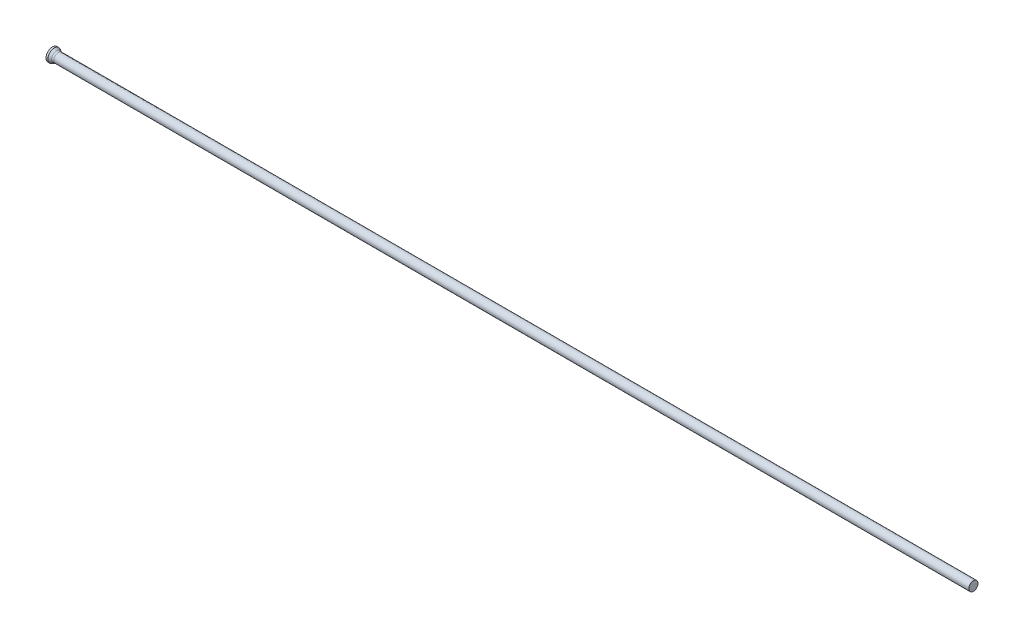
ISO-10303-21;
HEADER;
FILE_DESCRIPTION(('STEP AP214'),'2;1');
FILE_NAME('part.step','',(''),(''),'','','');
FILE_SCHEMA(('AUTOMOTIVE_DESIGN { 1 0 10303 214 1 1 1 1 }'));
ENDSEC;
DATA;
#1=APPLICATION_CONTEXT('core data for automotive mechanical design processes');
#2=APPLICATION_PROTOCOL_DEFINITION('international standard','automotive_design',2000,#1);
#3=PRODUCT_CONTEXT('',#1,'mechanical');
#4=PRODUCT('Part','Part','',(#3));
#5=PRODUCT_RELATED_PRODUCT_CATEGORY('part','',(#4));
#6=PRODUCT_DEFINITION_FORMATION('','',#4);
#7=PRODUCT_DEFINITION_CONTEXT('part definition',#1,'design');
#8=PRODUCT_DEFINITION('design','',#6,#7);
#9=PRODUCT_DEFINITION_SHAPE('','',#8);
#10=(LENGTH_UNIT() NAMED_UNIT(*) SI_UNIT(.MILLI.,.METRE.));
#11=(NAMED_UNIT(*) PLANE_ANGLE_UNIT() SI_UNIT($,.RADIAN.));
#12=(NAMED_UNIT(*) SI_UNIT($,.STERADIAN.) SOLID_ANGLE_UNIT());
#13=UNCERTAINTY_MEASURE_WITH_UNIT(LENGTH_MEASURE(1.E-05),#10,'distance_accuracy_value','');
#14=(GEOMETRIC_REPRESENTATION_CONTEXT(3) GLOBAL_UNCERTAINTY_ASSIGNED_CONTEXT((#13)) GLOBAL_UNIT_ASSIGNED_CONTEXT((#10,
#11,#12)) REPRESENTATION_CONTEXT('',''));
#15=CARTESIAN_POINT('',(0.,0.,0.));
#16=DIRECTION('',(0.,0.,1.));
#17=DIRECTION('',(1.,0.,0.));
#18=AXIS2_PLACEMENT_3D('',#15,#16,#17);
#19=CARTESIAN_POINT('',(0.,0.,0.));
#20=DIRECTION('',(1.,0.,0.));
#21=DIRECTION('',(0.,0.,-1.));
#22=AXIS2_PLACEMENT_3D('',#19,#20,#21);
#23=PLANE('',#22);
#24=CARTESIAN_POINT('',(0.,0.,0.));
#25=DIRECTION('',(-1.,0.,0.));
#26=DIRECTION('',(0.,0.,1.));
#27=AXIS2_PLACEMENT_3D('',#24,#25,#26);
#28=CIRCLE('',#27,1.75);
#29=CARTESIAN_POINT('',(0.,0.,1.75));
#30=VERTEX_POINT('',#29);
#31=EDGE_CURVE('E25',#30,#30,#28,.T.);
#32=ORIENTED_EDGE('',*,*,#31,.T.);
#33=EDGE_LOOP('',(#32));
#34=FACE_BOUND('',#33,.T.);
#35=ADVANCED_FACE('F14',(#34),#23,.F.);
#36=CARTESIAN_POINT('',(0.,0.,0.));
#37=DIRECTION('',(-1.,0.,0.));
#38=DIRECTION('',(0.,0.,1.));
#39=AXIS2_PLACEMENT_3D('',#36,#37,#38);
#40=CYLINDRICAL_SURFACE('',#39,1.75);
#41=ORIENTED_EDGE('',*,*,#31,.F.);
#42=EDGE_LOOP('',(#41));
#43=FACE_BOUND('',#42,.T.);
#44=CARTESIAN_POINT('',(0.503974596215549,0.,0.));
#45=DIRECTION('',(-1.,0.,0.));
#46=DIRECTION('',(0.,0.,1.));
#47=AXIS2_PLACEMENT_3D('',#44,#45,#46);
#48=CIRCLE('',#47,1.75);
#49=CARTESIAN_POINT('',(0.503974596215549,0.,1.75));
#50=VERTEX_POINT('',#49);
#51=EDGE_CURVE('E29',#50,#50,#48,.T.);
#52=ORIENTED_EDGE('',*,*,#51,.T.);
#53=EDGE_LOOP('',(#52));
#54=FACE_BOUND('',#53,.T.);
#55=ADVANCED_FACE('F53',(#43,#54),#40,.T.);
#56=CARTESIAN_POINT('',(1.37,0.,0.));
#57=DIRECTION('',(-1.,0.,0.));
#58=DIRECTION('',(0.,0.,1.));
#59=AXIS2_PLACEMENT_3D('',#56,#57,#58);
#60=CONICAL_SURFACE('',#59,1.25,0.523598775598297);
#61=CARTESIAN_POINT('',(1.13794919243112,0.,0.));
#62=DIRECTION('',(-1.,0.,0.));
#63=DIRECTION('',(0.,0.,1.));
#64=AXIS2_PLACEMENT_3D('',#61,#62,#63);
#65=CIRCLE('',#64,1.38397459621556);
#66=CARTESIAN_POINT('',(1.13794919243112,0.,1.38397459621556));
#67=VERTEX_POINT('',#66);
#68=EDGE_CURVE('E21',#67,#67,#65,.T.);
#69=ORIENTED_EDGE('',*,*,#68,.T.);
#70=EDGE_LOOP('',(#69));
#71=FACE_BOUND('',#70,.T.);
#72=ORIENTED_EDGE('',*,*,#51,.F.);
#73=EDGE_LOOP('',(#72));
#74=FACE_BOUND('',#73,.T.);
#75=ADVANCED_FACE('F50',(#71,#74),#60,.T.);
#76=CARTESIAN_POINT('',(0.,0.,0.));
#77=DIRECTION('',(-1.,0.,0.));
#78=DIRECTION('',(0.,0.,1.));
#79=AXIS2_PLACEMENT_3D('',#76,#77,#78);
#80=CYLINDRICAL_SURFACE('',#79,1.25);
#81=CARTESIAN_POINT('',(1.63794919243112,0.,0.));
#82=DIRECTION('',(-1.,0.,0.));
#83=DIRECTION('',(0.,0.,1.));
#84=AXIS2_PLACEMENT_3D('',#81,#82,#83);
#85=CIRCLE('',#84,1.25);
#86=CARTESIAN_POINT('',(1.63794919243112,0.,1.25));
#87=VERTEX_POINT('',#86);
#88=EDGE_CURVE('E9',#87,#87,#85,.F.);
#89=ORIENTED_EDGE('',*,*,#88,.T.);
#90=EDGE_LOOP('',(#89));
#91=FACE_BOUND('',#90,.T.);
#92=CARTESIAN_POINT('',(250.,0.,0.));
#93=DIRECTION('',(-1.,0.,0.));
#94=DIRECTION('',(0.,0.,1.));
#95=AXIS2_PLACEMENT_3D('',#92,#93,#94);
#96=CIRCLE('',#95,1.25);
#97=CARTESIAN_POINT('',(250.,0.,1.25));
#98=VERTEX_POINT('',#97);
#99=EDGE_CURVE('E34',#98,#98,#96,.T.);
#100=ORIENTED_EDGE('',*,*,#99,.T.);
#101=EDGE_LOOP('',(#100));
#102=FACE_BOUND('',#101,.T.);
#103=ADVANCED_FACE('F38',(#91,#102),#80,.T.);
#104=CARTESIAN_POINT('',(250.,1.25,0.));
#105=DIRECTION('',(-1.,0.,0.));
#106=DIRECTION('',(0.,0.,1.));
#107=AXIS2_PLACEMENT_3D('',#104,#105,#106);
#108=PLANE('',#107);
#109=ORIENTED_EDGE('',*,*,#99,.F.);
#110=EDGE_LOOP('',(#109));
#111=FACE_BOUND('',#110,.T.);
#112=ADVANCED_FACE('F40',(#111),#108,.F.);
#113=CARTESIAN_POINT('',(1.63794919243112,0.,0.));
#114=DIRECTION('',(-1.,0.,0.));
#115=DIRECTION('',(0.,0.,1.));
#116=AXIS2_PLACEMENT_3D('',#113,#114,#115);
#117=TOROIDAL_SURFACE('',#116,2.25,1.);
#118=ORIENTED_EDGE('',*,*,#88,.F.);
#119=EDGE_LOOP('',(#118));
#120=FACE_BOUND('',#119,.T.);
#121=ORIENTED_EDGE('',*,*,#68,.F.);
#122=EDGE_LOOP('',(#121));
#123=FACE_BOUND('',#122,.T.);
#124=ADVANCED_FACE('F16',(#120,#123),#117,.F.);
#125=CLOSED_SHELL('',(#35,#55,#75,#103,#112,#124));
#126=MANIFOLD_SOLID_BREP('B1',#125);
#127=ADVANCED_BREP_SHAPE_REPRESENTATION('',(#18,#126),#14);
#128=SHAPE_DEFINITION_REPRESENTATION(#9,#127);
ENDSEC;
END-ISO-10303-21;
